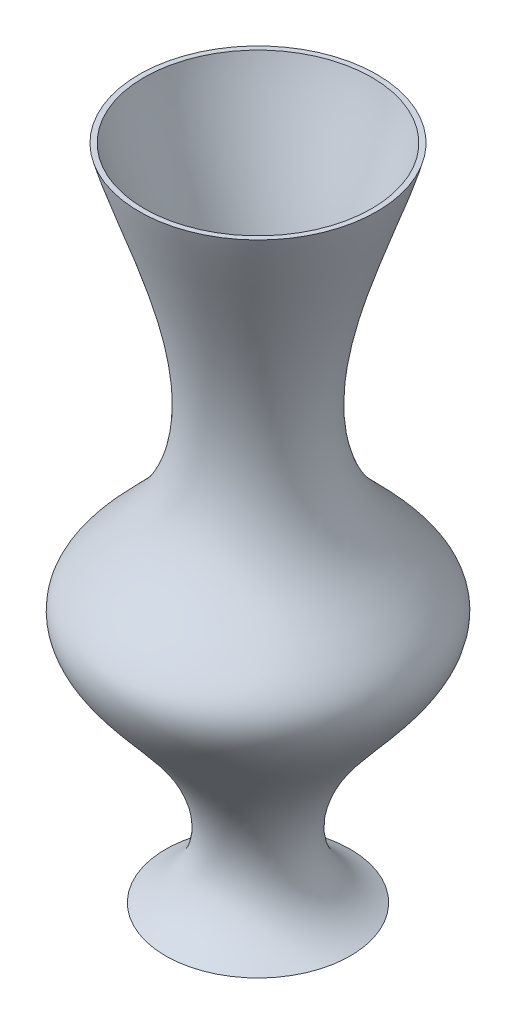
ISO-10303-21;
HEADER;
FILE_DESCRIPTION(('STEP AP214'),'2;1');
FILE_NAME('part.step','',(''),(''),'','','');
FILE_SCHEMA(('AUTOMOTIVE_DESIGN { 1 0 10303 214 1 1 1 1 }'));
ENDSEC;
DATA;
#1=APPLICATION_CONTEXT('core data for automotive mechanical design processes');
#2=APPLICATION_PROTOCOL_DEFINITION('international standard','automotive_design',2000,#1);
#3=PRODUCT_CONTEXT('',#1,'mechanical');
#4=PRODUCT('Part','Part','',(#3));
#5=PRODUCT_RELATED_PRODUCT_CATEGORY('part','',(#4));
#6=PRODUCT_DEFINITION_FORMATION('','',#4);
#7=PRODUCT_DEFINITION_CONTEXT('part definition',#1,'design');
#8=PRODUCT_DEFINITION('design','',#6,#7);
#9=PRODUCT_DEFINITION_SHAPE('','',#8);
#10=(LENGTH_UNIT() NAMED_UNIT(*) SI_UNIT(.MILLI.,.METRE.));
#11=(NAMED_UNIT(*) PLANE_ANGLE_UNIT() SI_UNIT($,.RADIAN.));
#12=(NAMED_UNIT(*) SI_UNIT($,.STERADIAN.) SOLID_ANGLE_UNIT());
#13=UNCERTAINTY_MEASURE_WITH_UNIT(LENGTH_MEASURE(1.E-05),#10,'distance_accuracy_value','');
#14=(GEOMETRIC_REPRESENTATION_CONTEXT(3) GLOBAL_UNCERTAINTY_ASSIGNED_CONTEXT((#13)) GLOBAL_UNIT_ASSIGNED_CONTEXT((#10,
#11,#12)) REPRESENTATION_CONTEXT('',''));
#15=CARTESIAN_POINT('',(0.,0.,0.));
#16=DIRECTION('',(0.,0.,1.));
#17=DIRECTION('',(1.,0.,0.));
#18=AXIS2_PLACEMENT_3D('',#15,#16,#17);
#19=CARTESIAN_POINT('',(48.4120263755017,267.969948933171,0.));
#20=DIRECTION('',(0.,1.,0.));
#21=DIRECTION('',(0.,0.,1.));
#22=AXIS2_PLACEMENT_3D('',#19,#20,#21);
#23=PLANE('',#22);
#24=CARTESIAN_POINT('',(0.,267.969948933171,0.));
#25=DIRECTION('',(0.,-1.,0.));
#26=DIRECTION('',(0.,0.,-1.));
#27=AXIS2_PLACEMENT_3D('',#24,#25,#26);
#28=CIRCLE('',#27,46.3400818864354);
#29=CARTESIAN_POINT('',(0.,267.969948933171,-46.3400818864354));
#30=VERTEX_POINT('',#29);
#31=EDGE_CURVE('E11',#30,#30,#28,.T.);
#32=ORIENTED_EDGE('',*,*,#31,.T.);
#33=EDGE_LOOP('',(#32));
#34=FACE_BOUND('',#33,.T.);
#35=CARTESIAN_POINT('',(0.,267.969948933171,0.));
#36=DIRECTION('',(0.,-1.,0.));
#37=DIRECTION('',(0.,0.,-1.));
#38=AXIS2_PLACEMENT_3D('',#35,#36,#37);
#39=CIRCLE('',#38,48.4120263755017);
#40=CARTESIAN_POINT('',(0.,267.969948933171,-48.4120263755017));
#41=VERTEX_POINT('',#40);
#42=EDGE_CURVE('E54',#41,#41,#39,.T.);
#43=ORIENTED_EDGE('',*,*,#42,.F.);
#44=EDGE_LOOP('',(#43));
#45=FACE_BOUND('',#44,.T.);
#46=ADVANCED_FACE('F43',(#34,#45),#23,.T.);
#47=CARTESIAN_POINT('',(37.6449292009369,0.,0.));
#48=CARTESIAN_POINT('',(14.3498820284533,10.7314003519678,0.));
#49=CARTESIAN_POINT('',(16.5334517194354,55.9499413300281,0.));
#50=CARTESIAN_POINT('',(79.7617919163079,101.124178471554,0.));
#51=CARTESIAN_POINT('',(-1.26532602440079,158.407081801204,0.));
#52=CARTESIAN_POINT('',(39.3511964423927,234.187848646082,0.));
#53=CARTESIAN_POINT('',(48.4120263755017,267.969948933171,0.));
#54=B_SPLINE_CURVE_WITH_KNOTS('',3,(#47,#48,#49,#50,#51,#52,#53),.UNSPECIFIED.,.F.,.F.,(4,1,1,1,
4),(0.,0.19799457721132,0.417111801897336,0.54063817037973,1.),.UNSPECIFIED.);
#55=CARTESIAN_POINT('',(0.,-14.7519304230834,0.));
#56=DIRECTION('',(0.,-1.,0.));
#57=AXIS1_PLACEMENT('',#55,#56);
#58=SURFACE_OF_REVOLUTION('',#54,#57);
#59=OFFSET_SURFACE('',#58,2.,.F.);
#60=ORIENTED_EDGE('',*,*,#31,.F.);
#61=EDGE_LOOP('',(#60));
#62=FACE_BOUND('',#61,.T.);
#63=CARTESIAN_POINT('',(0.,2.,0.));
#64=DIRECTION('',(0.,-1.,0.));
#65=DIRECTION('',(0.,0.,-1.));
#66=AXIS2_PLACEMENT_3D('',#63,#64,#65);
#67=CIRCLE('',#66,30.0660874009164);
#68=CARTESIAN_POINT('',(0.,2.,-30.0660874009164));
#69=VERTEX_POINT('',#68);
#70=EDGE_CURVE('E58',#69,#69,#67,.T.);
#71=ORIENTED_EDGE('',*,*,#70,.T.);
#72=EDGE_LOOP('',(#71));
#73=FACE_BOUND('',#72,.T.);
#74=ADVANCED_FACE('F67',(#62,#73),#59,.T.);
#75=CARTESIAN_POINT('',(37.6449292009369,0.,0.));
#76=CARTESIAN_POINT('',(14.3498820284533,10.7314003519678,0.));
#77=CARTESIAN_POINT('',(16.5334517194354,55.9499413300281,0.));
#78=CARTESIAN_POINT('',(79.7617919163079,101.124178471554,0.));
#79=CARTESIAN_POINT('',(-1.26532602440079,158.407081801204,0.));
#80=CARTESIAN_POINT('',(39.3511964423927,234.187848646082,0.));
#81=CARTESIAN_POINT('',(48.4120263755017,267.969948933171,0.));
#82=B_SPLINE_CURVE_WITH_KNOTS('',3,(#75,#76,#77,#78,#79,#80,#81),.UNSPECIFIED.,.F.,.F.,(4,1,1,1,
4),(0.,0.19799457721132,0.417111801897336,0.54063817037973,1.),.UNSPECIFIED.);
#83=CARTESIAN_POINT('',(0.,-14.7519304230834,0.));
#84=DIRECTION('',(0.,-1.,0.));
#85=AXIS1_PLACEMENT('',#83,#84);
#86=SURFACE_OF_REVOLUTION('',#82,#85);
#87=ORIENTED_EDGE('',*,*,#42,.T.);
#88=EDGE_LOOP('',(#87));
#89=FACE_BOUND('',#88,.T.);
#90=CARTESIAN_POINT('',(0.,0.,0.));
#91=DIRECTION('',(0.,-1.,0.));
#92=DIRECTION('',(0.,0.,-1.));
#93=AXIS2_PLACEMENT_3D('',#90,#91,#92);
#94=CIRCLE('',#93,37.6449292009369);
#95=CARTESIAN_POINT('',(0.,0.,-37.6449292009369));
#96=VERTEX_POINT('',#95);
#97=EDGE_CURVE('E61',#96,#96,#94,.T.);
#98=ORIENTED_EDGE('',*,*,#97,.F.);
#99=EDGE_LOOP('',(#98));
#100=FACE_BOUND('',#99,.T.);
#101=ADVANCED_FACE('F45',(#89,#100),#86,.F.);
#102=CARTESIAN_POINT('',(0.,0.,0.));
#103=DIRECTION('',(0.,-1.,0.));
#104=DIRECTION('',(0.,0.,-1.));
#105=AXIS2_PLACEMENT_3D('',#102,#103,#104);
#106=PLANE('',#105);
#107=ORIENTED_EDGE('',*,*,#97,.T.);
#108=EDGE_LOOP('',(#107));
#109=FACE_BOUND('',#108,.T.);
#110=ADVANCED_FACE('F71',(#109),#106,.T.);
#111=CARTESIAN_POINT('',(0.,2.,0.));
#112=DIRECTION('',(0.,-1.,0.));
#113=DIRECTION('',(0.,0.,-1.));
#114=AXIS2_PLACEMENT_3D('',#111,#112,#113);
#115=PLANE('',#114);
#116=ORIENTED_EDGE('',*,*,#70,.F.);
#117=EDGE_LOOP('',(#116));
#118=FACE_BOUND('',#117,.T.);
#119=ADVANCED_FACE('F69',(#118),#115,.F.);
#120=CLOSED_SHELL('',(#46,#74,#101,#110,#119));
#121=MANIFOLD_SOLID_BREP('B2',#120);
#122=CARTESIAN_POINT('',(37.6449292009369,0.,0.));
#123=CARTESIAN_POINT('',(14.3498820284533,10.7314003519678,0.));
#124=CARTESIAN_POINT('',(16.5334517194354,55.9499413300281,0.));
#125=CARTESIAN_POINT('',(79.7617919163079,101.124178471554,0.));
#126=CARTESIAN_POINT('',(-1.26532602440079,158.407081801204,0.));
#127=CARTESIAN_POINT('',(39.3511964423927,234.187848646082,0.));
#128=CARTESIAN_POINT('',(48.4120263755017,267.969948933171,0.));
#129=B_SPLINE_CURVE_WITH_KNOTS('',3,(#122,#123,#124,#125,#126,#127,#128),.UNSPECIFIED.,.F.,.F.,
(4,1,1,1,4),(0.,0.19799457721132,0.417111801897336,0.54063817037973,1.),.UNSPECIFIED.);
#130=CARTESIAN_POINT('',(0.,-14.7519304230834,0.));
#131=DIRECTION('',(0.,-1.,0.));
#132=AXIS1_PLACEMENT('',#130,#131);
#133=SURFACE_OF_REVOLUTION('',#129,#132);
#134=OFFSET_SURFACE('',#133,2.,.F.);
#135=CARTESIAN_POINT('',(0.,2.,0.));
#136=DIRECTION('',(0.,-1.,0.));
#137=DIRECTION('',(0.,0.,-1.));
#138=AXIS2_PLACEMENT_3D('',#135,#136,#137);
#139=CIRCLE('',#138,30.0660874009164);
#140=CARTESIAN_POINT('',(0.,2.,-30.0660874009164));
#141=VERTEX_POINT('',#140);
#142=EDGE_CURVE('E42',#141,#141,#139,.T.);
#143=ORIENTED_EDGE('',*,*,#142,.F.);
#144=EDGE_LOOP('',(#143));
#145=FACE_BOUND('',#144,.T.);
#146=CARTESIAN_POINT('',(0.,70.0435084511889,0.));
#147=DIRECTION('',(0.,-1.,0.));
#148=DIRECTION('',(0.,0.,-1.));
#149=AXIS2_PLACEMENT_3D('',#146,#147,#148);
#150=CIRCLE('',#149,38.4378858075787);
#151=CARTESIAN_POINT('',(0.,70.0435084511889,-38.4378858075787));
#152=VERTEX_POINT('',#151);
#153=EDGE_CURVE('E139',#152,#152,#150,.T.);
#154=ORIENTED_EDGE('',*,*,#153,.T.);
#155=EDGE_LOOP('',(#154));
#156=FACE_BOUND('',#155,.T.);
#157=ADVANCED_FACE('F135',(#145,#156),#134,.F.);
#158=CARTESIAN_POINT('',(0.,2.,0.));
#159=DIRECTION('',(0.,-1.,0.));
#160=DIRECTION('',(0.,0.,-1.));
#161=AXIS2_PLACEMENT_3D('',#158,#159,#160);
#162=PLANE('',#161);
#163=ORIENTED_EDGE('',*,*,#142,.T.);
#164=EDGE_LOOP('',(#163));
#165=FACE_BOUND('',#164,.T.);
#166=ADVANCED_FACE('F157',(#165),#162,.T.);
#167=CARTESIAN_POINT('',(-120.,70.0435084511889,0.));
#168=DIRECTION('',(0.,1.,0.));
#169=DIRECTION('',(0.,0.,1.));
#170=AXIS2_PLACEMENT_3D('',#167,#168,#169);
#171=PLANE('',#170);
#172=ORIENTED_EDGE('',*,*,#153,.F.);
#173=EDGE_LOOP('',(#172));
#174=FACE_BOUND('',#173,.T.);
#175=ADVANCED_FACE('F137',(#174),#171,.T.);
#176=CLOSED_SHELL('',(#157,#166,#175));
#177=MANIFOLD_SOLID_BREP('B6',#176);
#178=ADVANCED_BREP_SHAPE_REPRESENTATION('',(#18,#121,#177),#14);
#179=SHAPE_DEFINITION_REPRESENTATION(#9,#178);
ENDSEC;
END-ISO-10303-21;
